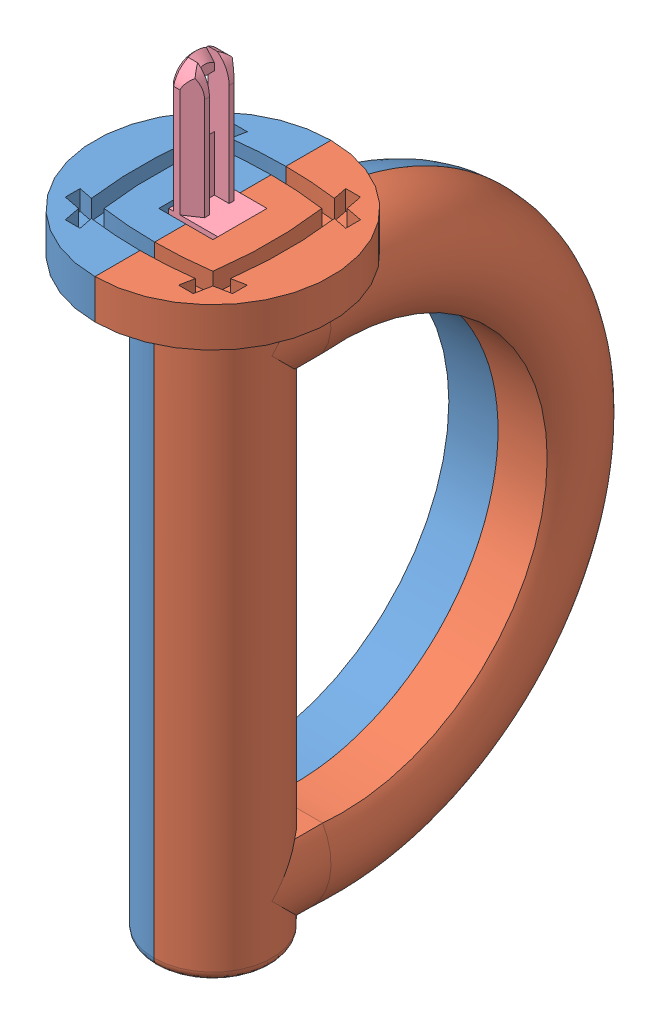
SolidWorks assembly sword assembly.SLDASM, configuration Default (file format 8000). Lengths in mm.
Overall size (48 157.19 104.01).
6 component instances, 4 part files, 14 mates.
Components (placement in the parent):
- sword half 1-1: sword half 1.SLDPRT [Default] at (48.7051 84.4089 90.2927) size (24.6 131.41 104.01)
- sword half 2-1: sword half 2.SLDPRT [Default] at (48.7051 84.4089 90.2927) size (24.6 131.54 103.68)
- sword connector (3)-1: sword connector (3).SLDPRT [Default] at (42.7051 54.7757 84.7927) size (10 10 10)
- sword connector (3)-2: sword connector (3).SLDPRT [Default] at (42.7051 -15.9578 85.7927) size (10 10 10)
- sword connector (3)-3: sword connector (3).SLDPRT [Default] at (42.7051 19.9089 18.5224) size (10 10 10)
- connector_falcon-1: connector_falcon.SLDPRT [Default] at (44.2051 114.4089 94.7927) x (0 -1 0) z (0 0 1) size (30.65 10 10)
Mates (geometry in assembly coordinates):
- Distance1: distance = 0.5 mm anti-aligned: plane of sword connector (3)-1 through (42.7051 54.7757 94.7927) normal (-1 0 0); plane of sword half 1-1 through (43.2051 84.4089 90.2927) normal (1 0 0)
- Coincident2: coincident anti-aligned: plane of sword half 1-1 through (43.2051 54.7757 84.7927) normal (0 0 1); plane of sword connector (3)-1 through (42.7051 54.7757 84.7927) normal (0 0 -1)
- Coincident3: coincident anti-aligned: plane of sword half 1-1 through (43.2051 54.7757 95.7927) normal (0 1 0); plane of sword connector (3)-1 through (52.7051 54.7757 94.7927) normal (0 -1 0)
- Distance2: distance = 0.5 mm anti-aligned: plane of sword connector (3)-3 through (42.7051 19.9089 28.5224) normal (-1 0 0); plane of sword half 1-1 through (43.2051 84.4089 90.2927) normal (1 0 0)
- Coincident5: coincident anti-aligned: plane of sword half 1-1 through (43.2051 29.9089 28.5224) normal (0 0 -1); plane of sword connector (3)-3 through (42.7051 19.9089 28.5224) normal (0 0 1)
- Coincident6: coincident anti-aligned: plane of sword half 1-1 through (43.2051 29.9089 17.5224) normal (0 -1 0); plane of sword connector (3)-3 through (42.7051 29.9089 28.5224) normal (0 1 0)
- Distance3: distance = 0.5 mm anti-aligned: plane of sword connector (3)-2 through (42.7051 -15.9578 95.7927) normal (-1 0 0); plane of sword half 1-1 through (43.2051 84.4089 90.2927) normal (1 0 0)
- Coincident8: coincident anti-aligned: plane of sword half 1-1 through (43.2051 -16.9578 95.7927) normal (0 0 -1); plane of sword connector (3)-2 through (42.7051 -15.9578 95.7927) normal (0 0 1)
- Coincident9: coincident anti-aligned: plane of sword half 1-1 through (43.2051 -5.9578 95.7927) normal (0 -1 0); plane of sword connector (3)-2 through (42.7051 -5.9578 95.7927) normal (0 1 0)
- Coincident10: coincident anti-aligned: plane of sword half 1-1 through (48.7051 92.4089 90.2927) normal (1 0 0); plane of sword half 2-1 through (48.7051 92.4089 90.2927) normal (-1 0 0)
- Coincident11: coincident aligned: plane of sword half 1-1 through (48.7051 92.4089 90.2927) normal (0 1 0); plane of sword half 2-1 through (48.7051 92.4089 90.2927) normal (0 1 0)
- Coincident12: coincident anti-aligned: line of sword half 1-1 through (48.7051 29.9089 28.5224) axis (0 -1 0); line of sword half 2-1 through (48.7051 18.9089 28.5224) axis (0 1 0)
- Coincident13: coincident: line of sword half 2-1 through (54.2051 92.4089 95.7927) axis (0 0 -1); line of connector_falcon-1 through (54.2051 92.4089 134.3338) axis (0 0 1)
- Coincident15: coincident anti-aligned: line of sword half 2-1 through (54.2051 92.4089 84.7927) axis (-1 0 0); line of connector_falcon-1 through (46.5051 92.4089 84.7927) axis (1 0 0)
